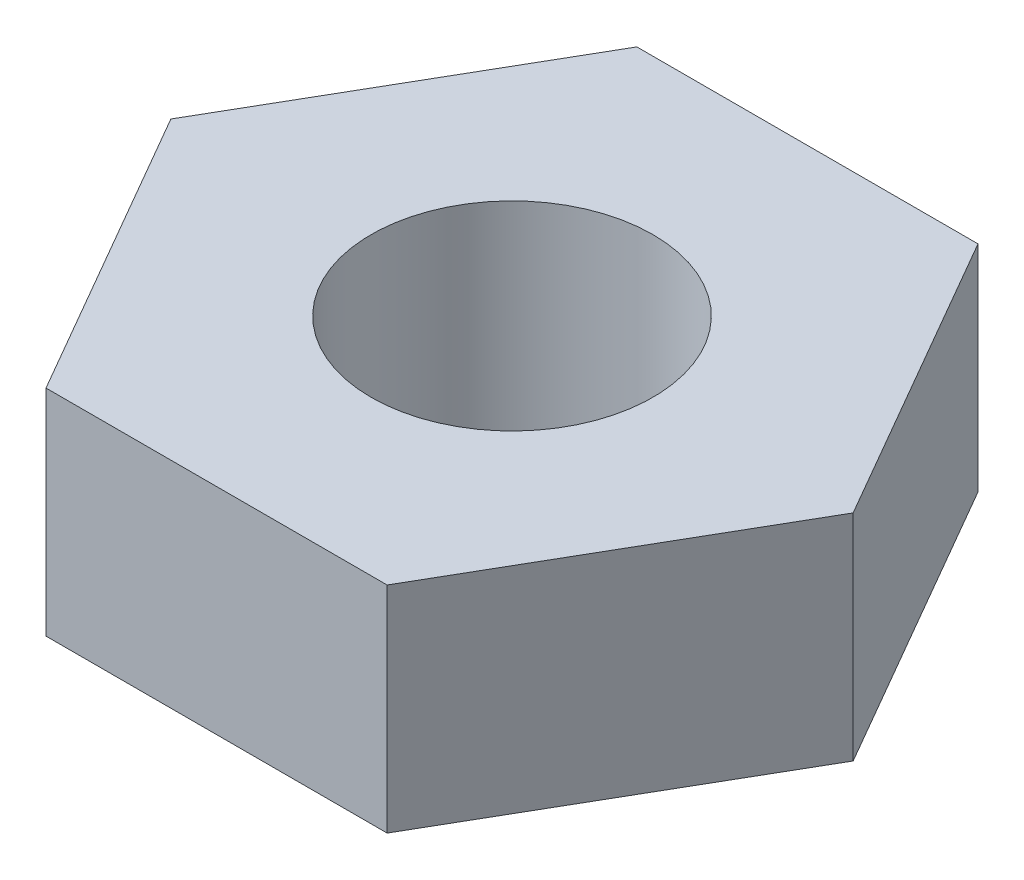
ISO-10303-21;
HEADER;
FILE_DESCRIPTION(('STEP AP214'),'2;1');
FILE_NAME('part.step','',(''),(''),'','','');
FILE_SCHEMA(('AUTOMOTIVE_DESIGN { 1 0 10303 214 1 1 1 1 }'));
ENDSEC;
DATA;
#1=APPLICATION_CONTEXT('core data for automotive mechanical design processes');
#2=APPLICATION_PROTOCOL_DEFINITION('international standard','automotive_design',2000,#1);
#3=PRODUCT_CONTEXT('',#1,'mechanical');
#4=PRODUCT('Part','Part','',(#3));
#5=PRODUCT_RELATED_PRODUCT_CATEGORY('part','',(#4));
#6=PRODUCT_DEFINITION_FORMATION('','',#4);
#7=PRODUCT_DEFINITION_CONTEXT('part definition',#1,'design');
#8=PRODUCT_DEFINITION('design','',#6,#7);
#9=PRODUCT_DEFINITION_SHAPE('','',#8);
#10=(LENGTH_UNIT() NAMED_UNIT(*) SI_UNIT(.MILLI.,.METRE.));
#11=(NAMED_UNIT(*) PLANE_ANGLE_UNIT() SI_UNIT($,.RADIAN.));
#12=(NAMED_UNIT(*) SI_UNIT($,.STERADIAN.) SOLID_ANGLE_UNIT());
#13=UNCERTAINTY_MEASURE_WITH_UNIT(LENGTH_MEASURE(1.E-05),#10,'distance_accuracy_value','');
#14=(GEOMETRIC_REPRESENTATION_CONTEXT(3) GLOBAL_UNCERTAINTY_ASSIGNED_CONTEXT((#13)) GLOBAL_UNIT_ASSIGNED_CONTEXT((#10,
#11,#12)) REPRESENTATION_CONTEXT('',''));
#15=CARTESIAN_POINT('',(0.,0.,0.));
#16=DIRECTION('',(0.,0.,1.));
#17=DIRECTION('',(1.,0.,0.));
#18=AXIS2_PLACEMENT_3D('',#15,#16,#17);
#19=CARTESIAN_POINT('',(0.,1.5875,0.));
#20=DIRECTION('',(0.,1.,0.));
#21=DIRECTION('',(0.,0.,1.));
#22=AXIS2_PLACEMENT_3D('',#19,#20,#21);
#23=PLANE('',#22);
#24=DIRECTION('',(0.499999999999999,0.,-0.866025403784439));
#25=VECTOR('',#24,1.);
#26=CARTESIAN_POINT('',(2.52049476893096,1.5875,4.365625));
#27=LINE('',#26,#25);
#28=CARTESIAN_POINT('',(2.52049476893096,1.5875,4.365625));
#29=VERTEX_POINT('',#28);
#30=CARTESIAN_POINT('',(5.04098953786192,1.5875,0.));
#31=VERTEX_POINT('',#30);
#32=EDGE_CURVE('E140',#29,#31,#27,.T.);
#33=ORIENTED_EDGE('',*,*,#32,.T.);
#34=DIRECTION('',(-0.5,0.,-0.866025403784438));
#35=VECTOR('',#34,1.);
#36=CARTESIAN_POINT('',(5.04098953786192,1.5875,0.));
#37=LINE('',#36,#35);
#38=CARTESIAN_POINT('',(2.52049476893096,1.5875,-4.365625));
#39=VERTEX_POINT('',#38);
#40=EDGE_CURVE('E94',#31,#39,#37,.T.);
#41=ORIENTED_EDGE('',*,*,#40,.T.);
#42=DIRECTION('',(-1.,0.,0.));
#43=VECTOR('',#42,1.);
#44=CARTESIAN_POINT('',(2.52049476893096,1.5875,-4.365625));
#45=LINE('',#44,#43);
#46=CARTESIAN_POINT('',(-2.52049476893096,1.5875,-4.365625));
#47=VERTEX_POINT('',#46);
#48=EDGE_CURVE('E107',#39,#47,#45,.T.);
#49=ORIENTED_EDGE('',*,*,#48,.T.);
#50=DIRECTION('',(-0.499999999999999,0.,0.866025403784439));
#51=VECTOR('',#50,1.);
#52=CARTESIAN_POINT('',(-2.52049476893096,1.5875,-4.365625));
#53=LINE('',#52,#51);
#54=CARTESIAN_POINT('',(-5.04098953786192,1.5875,0.));
#55=VERTEX_POINT('',#54);
#56=EDGE_CURVE('E101',#47,#55,#53,.T.);
#57=ORIENTED_EDGE('',*,*,#56,.T.);
#58=DIRECTION('',(0.5,0.,0.866025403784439));
#59=VECTOR('',#58,1.);
#60=CARTESIAN_POINT('',(-5.04098953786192,1.5875,0.));
#61=LINE('',#60,#59);
#62=CARTESIAN_POINT('',(-2.52049476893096,1.5875,4.365625));
#63=VERTEX_POINT('',#62);
#64=EDGE_CURVE('E105',#55,#63,#61,.T.);
#65=ORIENTED_EDGE('',*,*,#64,.T.);
#66=DIRECTION('',(1.,0.,0.));
#67=VECTOR('',#66,1.);
#68=CARTESIAN_POINT('',(-2.52049476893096,1.5875,4.365625));
#69=LINE('',#68,#67);
#70=EDGE_CURVE('E56',#63,#29,#69,.T.);
#71=ORIENTED_EDGE('',*,*,#70,.T.);
#72=EDGE_LOOP('',(#33,#41,#49,#57,#65,#71));
#73=FACE_BOUND('',#72,.T.);
#74=CARTESIAN_POINT('',(0.,1.5875,0.));
#75=DIRECTION('',(0.,1.,0.));
#76=DIRECTION('',(0.,0.,1.));
#77=AXIS2_PLACEMENT_3D('',#74,#75,#76);
#78=CIRCLE('',#77,2.0828);
#79=CARTESIAN_POINT('',(0.,1.5875,2.0828));
#80=VERTEX_POINT('',#79);
#81=EDGE_CURVE('E132',#80,#80,#78,.T.);
#82=ORIENTED_EDGE('',*,*,#81,.F.);
#83=EDGE_LOOP('',(#82));
#84=FACE_BOUND('',#83,.T.);
#85=ADVANCED_FACE('F39',(#73,#84),#23,.T.);
#86=CARTESIAN_POINT('',(0.,-1.5875,0.));
#87=DIRECTION('',(0.,1.,0.));
#88=DIRECTION('',(0.,0.,1.));
#89=AXIS2_PLACEMENT_3D('',#86,#87,#88);
#90=PLANE('',#89);
#91=DIRECTION('',(0.499999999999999,0.,-0.866025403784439));
#92=VECTOR('',#91,1.);
#93=CARTESIAN_POINT('',(2.52049476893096,-1.5875,4.365625));
#94=LINE('',#93,#92);
#95=CARTESIAN_POINT('',(2.52049476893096,-1.5875,4.365625));
#96=VERTEX_POINT('',#95);
#97=CARTESIAN_POINT('',(5.04098953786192,-1.5875,0.));
#98=VERTEX_POINT('',#97);
#99=EDGE_CURVE('E128',#96,#98,#94,.T.);
#100=ORIENTED_EDGE('',*,*,#99,.F.);
#101=DIRECTION('',(1.,0.,0.));
#102=VECTOR('',#101,1.);
#103=CARTESIAN_POINT('',(-2.52049476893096,-1.5875,4.365625));
#104=LINE('',#103,#102);
#105=CARTESIAN_POINT('',(-2.52049476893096,-1.5875,4.365625));
#106=VERTEX_POINT('',#105);
#107=EDGE_CURVE('E86',#106,#96,#104,.T.);
#108=ORIENTED_EDGE('',*,*,#107,.F.);
#109=DIRECTION('',(0.5,0.,0.866025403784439));
#110=VECTOR('',#109,1.);
#111=CARTESIAN_POINT('',(-5.04098953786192,-1.5875,0.));
#112=LINE('',#111,#110);
#113=CARTESIAN_POINT('',(-5.04098953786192,-1.5875,0.));
#114=VERTEX_POINT('',#113);
#115=EDGE_CURVE('E80',#114,#106,#112,.T.);
#116=ORIENTED_EDGE('',*,*,#115,.F.);
#117=DIRECTION('',(-0.499999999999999,0.,0.866025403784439));
#118=VECTOR('',#117,1.);
#119=CARTESIAN_POINT('',(-2.52049476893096,-1.5875,-4.365625));
#120=LINE('',#119,#118);
#121=CARTESIAN_POINT('',(-2.52049476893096,-1.5875,-4.365625));
#122=VERTEX_POINT('',#121);
#123=EDGE_CURVE('E115',#122,#114,#120,.T.);
#124=ORIENTED_EDGE('',*,*,#123,.F.);
#125=DIRECTION('',(-1.,0.,0.));
#126=VECTOR('',#125,1.);
#127=CARTESIAN_POINT('',(2.52049476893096,-1.5875,-4.365625));
#128=LINE('',#127,#126);
#129=CARTESIAN_POINT('',(2.52049476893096,-1.5875,-4.365625));
#130=VERTEX_POINT('',#129);
#131=EDGE_CURVE('E134',#130,#122,#128,.T.);
#132=ORIENTED_EDGE('',*,*,#131,.F.);
#133=DIRECTION('',(-0.5,0.,-0.866025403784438));
#134=VECTOR('',#133,1.);
#135=CARTESIAN_POINT('',(5.04098953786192,-1.5875,0.));
#136=LINE('',#135,#134);
#137=EDGE_CURVE('E131',#98,#130,#136,.T.);
#138=ORIENTED_EDGE('',*,*,#137,.F.);
#139=EDGE_LOOP('',(#100,#108,#116,#124,#132,#138));
#140=FACE_BOUND('',#139,.T.);
#141=CARTESIAN_POINT('',(0.,-1.5875,0.));
#142=DIRECTION('',(0.,1.,0.));
#143=DIRECTION('',(0.,0.,1.));
#144=AXIS2_PLACEMENT_3D('',#141,#142,#143);
#145=CIRCLE('',#144,2.0828);
#146=CARTESIAN_POINT('',(0.,-1.5875,2.0828));
#147=VERTEX_POINT('',#146);
#148=EDGE_CURVE('E235',#147,#147,#145,.T.);
#149=ORIENTED_EDGE('',*,*,#148,.T.);
#150=EDGE_LOOP('',(#149));
#151=FACE_BOUND('',#150,.T.);
#152=ADVANCED_FACE('F149',(#140,#151),#90,.F.);
#153=CARTESIAN_POINT('',(2.52049476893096,1.5875,4.365625));
#154=DIRECTION('',(-0.866025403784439,0.,-0.499999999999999));
#155=DIRECTION('',(-0.499999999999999,0.,0.866025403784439));
#156=AXIS2_PLACEMENT_3D('',#153,#154,#155);
#157=PLANE('',#156);
#158=ORIENTED_EDGE('',*,*,#99,.T.);
#159=DIRECTION('',(0.,-1.,0.));
#160=VECTOR('',#159,1.);
#161=CARTESIAN_POINT('',(5.04098953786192,1.5875,0.));
#162=LINE('',#161,#160);
#163=EDGE_CURVE('E11',#31,#98,#162,.T.);
#164=ORIENTED_EDGE('',*,*,#163,.F.);
#165=ORIENTED_EDGE('',*,*,#32,.F.);
#166=DIRECTION('',(0.,-1.,0.));
#167=VECTOR('',#166,1.);
#168=CARTESIAN_POINT('',(2.52049476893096,1.5875,4.365625));
#169=LINE('',#168,#167);
#170=EDGE_CURVE('E124',#29,#96,#169,.T.);
#171=ORIENTED_EDGE('',*,*,#170,.T.);
#172=EDGE_LOOP('',(#158,#164,#165,#171));
#173=FACE_BOUND('',#172,.T.);
#174=ADVANCED_FACE('F41',(#173),#157,.F.);
#175=CARTESIAN_POINT('',(5.04098953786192,1.5875,0.));
#176=DIRECTION('',(-0.866025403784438,0.,0.5));
#177=DIRECTION('',(0.5,0.,0.866025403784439));
#178=AXIS2_PLACEMENT_3D('',#175,#176,#177);
#179=PLANE('',#178);
#180=ORIENTED_EDGE('',*,*,#137,.T.);
#181=DIRECTION('',(0.,-1.,0.));
#182=VECTOR('',#181,1.);
#183=CARTESIAN_POINT('',(2.52049476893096,1.5875,-4.365625));
#184=LINE('',#183,#182);
#185=EDGE_CURVE('E48',#39,#130,#184,.T.);
#186=ORIENTED_EDGE('',*,*,#185,.F.);
#187=ORIENTED_EDGE('',*,*,#40,.F.);
#188=ORIENTED_EDGE('',*,*,#163,.T.);
#189=EDGE_LOOP('',(#180,#186,#187,#188));
#190=FACE_BOUND('',#189,.T.);
#191=ADVANCED_FACE('F174',(#190),#179,.F.);
#192=CARTESIAN_POINT('',(2.52049476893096,1.5875,-4.365625));
#193=DIRECTION('',(0.,0.,1.));
#194=DIRECTION('',(1.,0.,0.));
#195=AXIS2_PLACEMENT_3D('',#192,#193,#194);
#196=PLANE('',#195);
#197=ORIENTED_EDGE('',*,*,#131,.T.);
#198=DIRECTION('',(0.,-1.,0.));
#199=VECTOR('',#198,1.);
#200=CARTESIAN_POINT('',(-2.52049476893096,1.5875,-4.365625));
#201=LINE('',#200,#199);
#202=EDGE_CURVE('E116',#47,#122,#201,.T.);
#203=ORIENTED_EDGE('',*,*,#202,.F.);
#204=ORIENTED_EDGE('',*,*,#48,.F.);
#205=ORIENTED_EDGE('',*,*,#185,.T.);
#206=EDGE_LOOP('',(#197,#203,#204,#205));
#207=FACE_BOUND('',#206,.T.);
#208=ADVANCED_FACE('F146',(#207),#196,.F.);
#209=CARTESIAN_POINT('',(-2.52049476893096,1.5875,-4.365625));
#210=DIRECTION('',(0.866025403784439,0.,0.499999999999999));
#211=DIRECTION('',(0.499999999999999,0.,-0.866025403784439));
#212=AXIS2_PLACEMENT_3D('',#209,#210,#211);
#213=PLANE('',#212);
#214=ORIENTED_EDGE('',*,*,#123,.T.);
#215=DIRECTION('',(0.,-1.,0.));
#216=VECTOR('',#215,1.);
#217=CARTESIAN_POINT('',(-5.04098953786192,1.5875,0.));
#218=LINE('',#217,#216);
#219=EDGE_CURVE('E112',#55,#114,#218,.T.);
#220=ORIENTED_EDGE('',*,*,#219,.F.);
#221=ORIENTED_EDGE('',*,*,#56,.F.);
#222=ORIENTED_EDGE('',*,*,#202,.T.);
#223=EDGE_LOOP('',(#214,#220,#221,#222));
#224=FACE_BOUND('',#223,.T.);
#225=ADVANCED_FACE('F113',(#224),#213,.F.);
#226=CARTESIAN_POINT('',(-5.04098953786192,1.5875,0.));
#227=DIRECTION('',(0.866025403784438,0.,-0.5));
#228=DIRECTION('',(-0.5,0.,-0.866025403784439));
#229=AXIS2_PLACEMENT_3D('',#226,#227,#228);
#230=PLANE('',#229);
#231=ORIENTED_EDGE('',*,*,#115,.T.);
#232=DIRECTION('',(0.,-1.,0.));
#233=VECTOR('',#232,1.);
#234=CARTESIAN_POINT('',(-2.52049476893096,1.5875,4.365625));
#235=LINE('',#234,#233);
#236=EDGE_CURVE('E117',#63,#106,#235,.T.);
#237=ORIENTED_EDGE('',*,*,#236,.F.);
#238=ORIENTED_EDGE('',*,*,#64,.F.);
#239=ORIENTED_EDGE('',*,*,#219,.T.);
#240=EDGE_LOOP('',(#231,#237,#238,#239));
#241=FACE_BOUND('',#240,.T.);
#242=ADVANCED_FACE('F119',(#241),#230,.F.);
#243=CARTESIAN_POINT('',(-2.52049476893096,1.5875,4.365625));
#244=DIRECTION('',(0.,0.,-1.));
#245=DIRECTION('',(-1.,0.,0.));
#246=AXIS2_PLACEMENT_3D('',#243,#244,#245);
#247=PLANE('',#246);
#248=ORIENTED_EDGE('',*,*,#107,.T.);
#249=ORIENTED_EDGE('',*,*,#170,.F.);
#250=ORIENTED_EDGE('',*,*,#70,.F.);
#251=ORIENTED_EDGE('',*,*,#236,.T.);
#252=EDGE_LOOP('',(#248,#249,#250,#251));
#253=FACE_BOUND('',#252,.T.);
#254=ADVANCED_FACE('F154',(#253),#247,.F.);
#255=CARTESIAN_POINT('',(0.,1.5875,0.));
#256=DIRECTION('',(0.,-1.,0.));
#257=DIRECTION('',(0.,0.,-1.));
#258=AXIS2_PLACEMENT_3D('',#255,#256,#257);
#259=CYLINDRICAL_SURFACE('',#258,2.0828);
#260=ORIENTED_EDGE('',*,*,#81,.T.);
#261=EDGE_LOOP('',(#260));
#262=FACE_BOUND('',#261,.T.);
#263=ORIENTED_EDGE('',*,*,#148,.F.);
#264=EDGE_LOOP('',(#263));
#265=FACE_BOUND('',#264,.T.);
#266=ADVANCED_FACE('F156',(#262,#265),#259,.F.);
#267=CLOSED_SHELL('',(#85,#152,#174,#191,#208,#225,#242,#254,#266));
#268=MANIFOLD_SOLID_BREP('B2',#267);
#269=ADVANCED_BREP_SHAPE_REPRESENTATION('',(#18,#268),#14);
#270=SHAPE_DEFINITION_REPRESENTATION(#9,#269);
ENDSEC;
END-ISO-10303-21;
